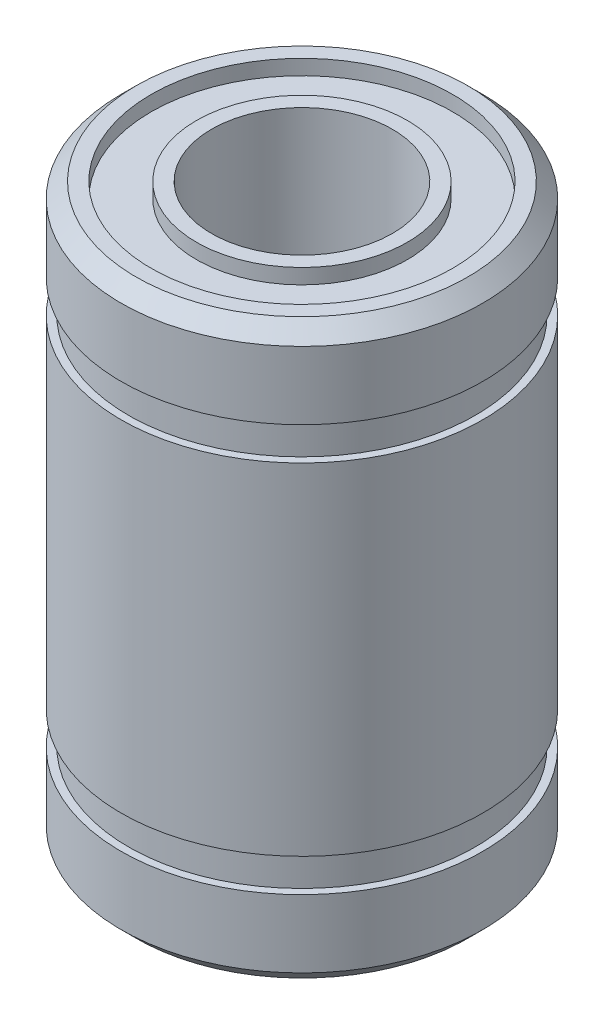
from build123d import *

# Parameters (mm, degrees)
SKETCH2_R          = 5
SKETCH2_R_2        = 3.5
CUT_EXTRUDE1_DEPTH = 0.5


with BuildPart() as part:
    # Sketch1 → Revolve1 (revolve)
    with BuildSketch(Plane.XY, mode=Mode.PRIVATE) as revolve1_sk:
        Polygon((3, -9.5), (3, 9.5), (5.5, 9.5), (6, 9), (6, 6.75), (5.75, 6.75), (5.75, 5.65), (6, 5.65), (6, -5.65), (5.75, -5.65), (5.75, -6.75), (6, -6.75), (6, -9), (5.5, -9.5), align=None)
    revolve(revolve1_sk.sketch.rotate(Axis((0, 9.5, 0), (0, -1, 0)), 180), axis=Axis((0, 9.5, 0), (0, -1, 0)))

    # Sketch2 → Cut-Extrude1 (cut)
    with BuildSketch(Plane(origin=(0, 9.5, 0), x_dir=(1, 0, 0), z_dir=(0, 1, 0))):
        with Locations(Location((0, 0, 0), (0, 0, 180))):
            Circle(SKETCH2_R)
        with Locations(Location((0, 0, 0), (0, 0, 180))):
            Circle(SKETCH2_R_2, mode=Mode.SUBTRACT)
    cut_extrude1 = extrude(amount=-CUT_EXTRUDE1_DEPTH, mode=Mode.SUBTRACT)

    # Mirror1: Cut-Extrude1 across plane
    add(cut_extrude1.mirror(Plane.ZX), mode=Mode.SUBTRACT)


solid = part.part
